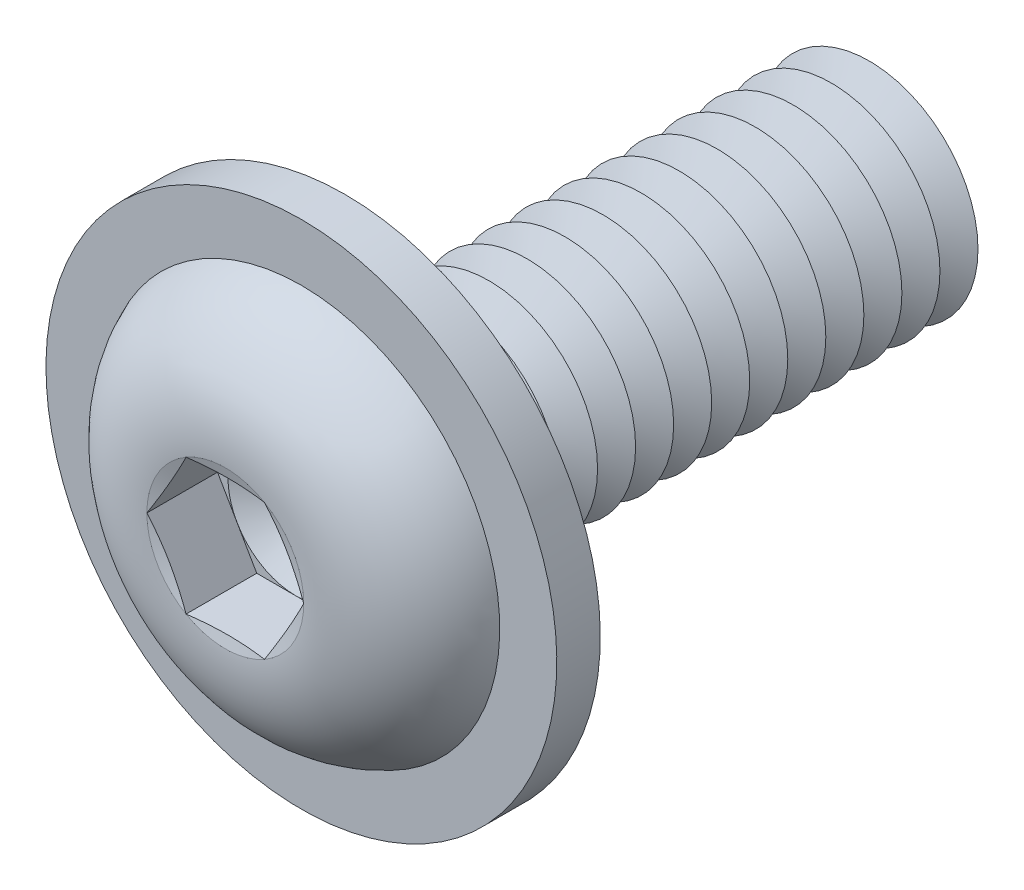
ISO-10303-21;
HEADER;
FILE_DESCRIPTION(('STEP AP214'),'2;1');
FILE_NAME('part.step','',(''),(''),'','','');
FILE_SCHEMA(('AUTOMOTIVE_DESIGN { 1 0 10303 214 1 1 1 1 }'));
ENDSEC;
DATA;
#1=APPLICATION_CONTEXT('core data for automotive mechanical design processes');
#2=APPLICATION_PROTOCOL_DEFINITION('international standard','automotive_design',2000,#1);
#3=PRODUCT_CONTEXT('',#1,'mechanical');
#4=PRODUCT('Part','Part','',(#3));
#5=PRODUCT_RELATED_PRODUCT_CATEGORY('part','',(#4));
#6=PRODUCT_DEFINITION_FORMATION('','',#4);
#7=PRODUCT_DEFINITION_CONTEXT('part definition',#1,'design');
#8=PRODUCT_DEFINITION('design','',#6,#7);
#9=PRODUCT_DEFINITION_SHAPE('','',#8);
#10=(LENGTH_UNIT() NAMED_UNIT(*) SI_UNIT(.MILLI.,.METRE.));
#11=(NAMED_UNIT(*) PLANE_ANGLE_UNIT() SI_UNIT($,.RADIAN.));
#12=(NAMED_UNIT(*) SI_UNIT($,.STERADIAN.) SOLID_ANGLE_UNIT());
#13=UNCERTAINTY_MEASURE_WITH_UNIT(LENGTH_MEASURE(1.E-05),#10,'distance_accuracy_value','');
#14=(GEOMETRIC_REPRESENTATION_CONTEXT(3) GLOBAL_UNCERTAINTY_ASSIGNED_CONTEXT((#13)) GLOBAL_UNIT_ASSIGNED_CONTEXT((#10,
#11,#12)) REPRESENTATION_CONTEXT('',''));
#15=CARTESIAN_POINT('',(0.,0.,0.));
#16=DIRECTION('',(0.,0.,1.));
#17=DIRECTION('',(1.,0.,0.));
#18=AXIS2_PLACEMENT_3D('',#15,#16,#17);
#19=CARTESIAN_POINT('',(0.,0.,-7.55));
#20=DIRECTION('',(0.,0.,1.));
#21=DIRECTION('',(1.,0.,0.));
#22=AXIS2_PLACEMENT_3D('',#19,#20,#21);
#23=CONICAL_SURFACE('',#22,2.,1.0471975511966);
#24=CARTESIAN_POINT('',(0.,0.,-7.9));
#25=DIRECTION('',(0.,0.,1.));
#26=DIRECTION('',(1.,0.,0.));
#27=AXIS2_PLACEMENT_3D('',#24,#25,#26);
#28=CIRCLE('',#27,1.3937822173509);
#29=CARTESIAN_POINT('',(1.3937822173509,0.,-7.9));
#30=VERTEX_POINT('',#29);
#31=EDGE_CURVE('E323',#30,#30,#28,.T.);
#32=ORIENTED_EDGE('',*,*,#31,.T.);
#33=EDGE_LOOP('',(#32));
#34=FACE_BOUND('',#33,.T.);
#35=CARTESIAN_POINT('',(0.,0.,-7.55));
#36=DIRECTION('',(0.,0.,1.));
#37=DIRECTION('',(1.,0.,0.));
#38=AXIS2_PLACEMENT_3D('',#35,#36,#37);
#39=CIRCLE('',#38,2.);
#40=CARTESIAN_POINT('',(2.,0.,-7.55));
#41=VERTEX_POINT('',#40);
#42=EDGE_CURVE('E319',#41,#41,#39,.T.);
#43=ORIENTED_EDGE('',*,*,#42,.F.);
#44=EDGE_LOOP('',(#43));
#45=FACE_BOUND('',#44,.T.);
#46=ADVANCED_FACE('F39',(#34,#45),#23,.T.);
#47=CARTESIAN_POINT('',(0.,0.,-7.9));
#48=DIRECTION('',(0.,0.,-1.));
#49=DIRECTION('',(-1.,0.,0.));
#50=AXIS2_PLACEMENT_3D('',#47,#48,#49);
#51=CONICAL_SURFACE('',#50,1.3937822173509,1.0471975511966);
#52=CARTESIAN_POINT('',(0.,0.,-8.25));
#53=DIRECTION('',(0.,0.,1.));
#54=DIRECTION('',(1.,0.,0.));
#55=AXIS2_PLACEMENT_3D('',#52,#53,#54);
#56=CIRCLE('',#55,2.);
#57=CARTESIAN_POINT('',(2.,0.,-8.25));
#58=VERTEX_POINT('',#57);
#59=EDGE_CURVE('E327',#58,#58,#56,.T.);
#60=ORIENTED_EDGE('',*,*,#59,.T.);
#61=EDGE_LOOP('',(#60));
#62=FACE_BOUND('',#61,.T.);
#63=ORIENTED_EDGE('',*,*,#31,.F.);
#64=EDGE_LOOP('',(#63));
#65=FACE_BOUND('',#64,.T.);
#66=ADVANCED_FACE('F448',(#62,#65),#51,.T.);
#67=CARTESIAN_POINT('',(0.,2.00000000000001,-10.));
#68=DIRECTION('',(0.,0.,-1.));
#69=DIRECTION('',(-1.,0.,0.));
#70=AXIS2_PLACEMENT_3D('',#67,#68,#69);
#71=PLANE('',#70);
#72=CARTESIAN_POINT('',(0.,0.,-10.));
#73=DIRECTION('',(0.,0.,1.));
#74=DIRECTION('',(1.,0.,0.));
#75=AXIS2_PLACEMENT_3D('',#72,#73,#74);
#76=CIRCLE('',#75,1.3937822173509);
#77=CARTESIAN_POINT('',(1.3937822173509,0.,-10.));
#78=VERTEX_POINT('',#77);
#79=EDGE_CURVE('E347',#78,#78,#76,.T.);
#80=ORIENTED_EDGE('',*,*,#79,.F.);
#81=EDGE_LOOP('',(#80));
#82=FACE_BOUND('',#81,.T.);
#83=ADVANCED_FACE('F454',(#82),#71,.T.);
#84=CARTESIAN_POINT('',(0.,0.,-9.65));
#85=DIRECTION('',(0.,0.,1.));
#86=DIRECTION('',(1.,0.,0.));
#87=AXIS2_PLACEMENT_3D('',#84,#85,#86);
#88=CONICAL_SURFACE('',#87,2.,1.0471975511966);
#89=ORIENTED_EDGE('',*,*,#79,.T.);
#90=EDGE_LOOP('',(#89));
#91=FACE_BOUND('',#90,.T.);
#92=CARTESIAN_POINT('',(0.,0.,-9.65));
#93=DIRECTION('',(0.,0.,1.));
#94=DIRECTION('',(1.,0.,0.));
#95=AXIS2_PLACEMENT_3D('',#92,#93,#94);
#96=CIRCLE('',#95,2.);
#97=CARTESIAN_POINT('',(2.,0.,-9.65));
#98=VERTEX_POINT('',#97);
#99=EDGE_CURVE('E343',#98,#98,#96,.T.);
#100=ORIENTED_EDGE('',*,*,#99,.F.);
#101=EDGE_LOOP('',(#100));
#102=FACE_BOUND('',#101,.T.);
#103=ADVANCED_FACE('F473',(#91,#102),#88,.T.);
#104=CARTESIAN_POINT('',(0.,0.,-9.3));
#105=DIRECTION('',(0.,0.,-1.));
#106=DIRECTION('',(-1.,0.,0.));
#107=AXIS2_PLACEMENT_3D('',#104,#105,#106);
#108=CONICAL_SURFACE('',#107,1.3937822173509,1.0471975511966);
#109=ORIENTED_EDGE('',*,*,#99,.T.);
#110=EDGE_LOOP('',(#109));
#111=FACE_BOUND('',#110,.T.);
#112=CARTESIAN_POINT('',(0.,0.,-9.3));
#113=DIRECTION('',(0.,0.,1.));
#114=DIRECTION('',(1.,0.,0.));
#115=AXIS2_PLACEMENT_3D('',#112,#113,#114);
#116=CIRCLE('',#115,1.3937822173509);
#117=CARTESIAN_POINT('',(1.3937822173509,0.,-9.3));
#118=VERTEX_POINT('',#117);
#119=EDGE_CURVE('E339',#118,#118,#116,.T.);
#120=ORIENTED_EDGE('',*,*,#119,.F.);
#121=EDGE_LOOP('',(#120));
#122=FACE_BOUND('',#121,.T.);
#123=ADVANCED_FACE('F470',(#111,#122),#108,.T.);
#124=CARTESIAN_POINT('',(0.,0.,-8.95));
#125=DIRECTION('',(0.,0.,1.));
#126=DIRECTION('',(1.,0.,0.));
#127=AXIS2_PLACEMENT_3D('',#124,#125,#126);
#128=CONICAL_SURFACE('',#127,2.,1.0471975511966);
#129=ORIENTED_EDGE('',*,*,#119,.T.);
#130=EDGE_LOOP('',(#129));
#131=FACE_BOUND('',#130,.T.);
#132=CARTESIAN_POINT('',(0.,0.,-8.95));
#133=DIRECTION('',(0.,0.,1.));
#134=DIRECTION('',(1.,0.,0.));
#135=AXIS2_PLACEMENT_3D('',#132,#133,#134);
#136=CIRCLE('',#135,2.);
#137=CARTESIAN_POINT('',(2.,0.,-8.95));
#138=VERTEX_POINT('',#137);
#139=EDGE_CURVE('E335',#138,#138,#136,.T.);
#140=ORIENTED_EDGE('',*,*,#139,.F.);
#141=EDGE_LOOP('',(#140));
#142=FACE_BOUND('',#141,.T.);
#143=ADVANCED_FACE('F464',(#131,#142),#128,.T.);
#144=CARTESIAN_POINT('',(0.,0.,-8.6));
#145=DIRECTION('',(0.,0.,-1.));
#146=DIRECTION('',(-1.,0.,0.));
#147=AXIS2_PLACEMENT_3D('',#144,#145,#146);
#148=CONICAL_SURFACE('',#147,1.3937822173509,1.0471975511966);
#149=ORIENTED_EDGE('',*,*,#139,.T.);
#150=EDGE_LOOP('',(#149));
#151=FACE_BOUND('',#150,.T.);
#152=CARTESIAN_POINT('',(0.,0.,-8.6));
#153=DIRECTION('',(0.,0.,1.));
#154=DIRECTION('',(1.,0.,0.));
#155=AXIS2_PLACEMENT_3D('',#152,#153,#154);
#156=CIRCLE('',#155,1.3937822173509);
#157=CARTESIAN_POINT('',(1.3937822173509,0.,-8.6));
#158=VERTEX_POINT('',#157);
#159=EDGE_CURVE('E331',#158,#158,#156,.T.);
#160=ORIENTED_EDGE('',*,*,#159,.F.);
#161=EDGE_LOOP('',(#160));
#162=FACE_BOUND('',#161,.T.);
#163=ADVANCED_FACE('F460',(#151,#162),#148,.T.);
#164=CARTESIAN_POINT('',(0.,0.,-8.25));
#165=DIRECTION('',(0.,0.,1.));
#166=DIRECTION('',(1.,0.,0.));
#167=AXIS2_PLACEMENT_3D('',#164,#165,#166);
#168=CONICAL_SURFACE('',#167,2.,1.0471975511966);
#169=ORIENTED_EDGE('',*,*,#159,.T.);
#170=EDGE_LOOP('',(#169));
#171=FACE_BOUND('',#170,.T.);
#172=ORIENTED_EDGE('',*,*,#59,.F.);
#173=EDGE_LOOP('',(#172));
#174=FACE_BOUND('',#173,.T.);
#175=ADVANCED_FACE('F463',(#171,#174),#168,.T.);
#176=CARTESIAN_POINT('',(0.,0.,-6.85));
#177=DIRECTION('',(0.,0.,1.));
#178=DIRECTION('',(1.,0.,0.));
#179=AXIS2_PLACEMENT_3D('',#176,#177,#178);
#180=CONICAL_SURFACE('',#179,2.,1.0471975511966);
#181=CARTESIAN_POINT('',(0.,0.,-7.2));
#182=DIRECTION('',(0.,0.,1.));
#183=DIRECTION('',(1.,0.,0.));
#184=AXIS2_PLACEMENT_3D('',#181,#182,#183);
#185=CIRCLE('',#184,1.3937822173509);
#186=CARTESIAN_POINT('',(1.3937822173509,0.,-7.2));
#187=VERTEX_POINT('',#186);
#188=EDGE_CURVE('E315',#187,#187,#185,.T.);
#189=ORIENTED_EDGE('',*,*,#188,.T.);
#190=EDGE_LOOP('',(#189));
#191=FACE_BOUND('',#190,.T.);
#192=CARTESIAN_POINT('',(0.,0.,-6.85));
#193=DIRECTION('',(0.,0.,1.));
#194=DIRECTION('',(1.,0.,0.));
#195=AXIS2_PLACEMENT_3D('',#192,#193,#194);
#196=CIRCLE('',#195,2.);
#197=CARTESIAN_POINT('',(2.,0.,-6.85));
#198=VERTEX_POINT('',#197);
#199=EDGE_CURVE('E311',#198,#198,#196,.T.);
#200=ORIENTED_EDGE('',*,*,#199,.F.);
#201=EDGE_LOOP('',(#200));
#202=FACE_BOUND('',#201,.T.);
#203=ADVANCED_FACE('F468',(#191,#202),#180,.T.);
#204=CARTESIAN_POINT('',(0.,0.,-7.2));
#205=DIRECTION('',(0.,0.,-1.));
#206=DIRECTION('',(-1.,0.,0.));
#207=AXIS2_PLACEMENT_3D('',#204,#205,#206);
#208=CONICAL_SURFACE('',#207,1.3937822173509,1.0471975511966);
#209=ORIENTED_EDGE('',*,*,#42,.T.);
#210=EDGE_LOOP('',(#209));
#211=FACE_BOUND('',#210,.T.);
#212=ORIENTED_EDGE('',*,*,#188,.F.);
#213=EDGE_LOOP('',(#212));
#214=FACE_BOUND('',#213,.T.);
#215=ADVANCED_FACE('F519',(#211,#214),#208,.T.);
#216=CARTESIAN_POINT('',(0.,0.,-6.15));
#217=DIRECTION('',(0.,0.,1.));
#218=DIRECTION('',(1.,0.,0.));
#219=AXIS2_PLACEMENT_3D('',#216,#217,#218);
#220=CONICAL_SURFACE('',#219,2.,1.0471975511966);
#221=CARTESIAN_POINT('',(0.,0.,-6.5));
#222=DIRECTION('',(0.,0.,1.));
#223=DIRECTION('',(1.,0.,0.));
#224=AXIS2_PLACEMENT_3D('',#221,#222,#223);
#225=CIRCLE('',#224,1.3937822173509);
#226=CARTESIAN_POINT('',(1.3937822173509,0.,-6.5));
#227=VERTEX_POINT('',#226);
#228=EDGE_CURVE('E307',#227,#227,#225,.T.);
#229=ORIENTED_EDGE('',*,*,#228,.T.);
#230=EDGE_LOOP('',(#229));
#231=FACE_BOUND('',#230,.T.);
#232=CARTESIAN_POINT('',(0.,0.,-6.15));
#233=DIRECTION('',(0.,0.,1.));
#234=DIRECTION('',(1.,0.,0.));
#235=AXIS2_PLACEMENT_3D('',#232,#233,#234);
#236=CIRCLE('',#235,2.);
#237=CARTESIAN_POINT('',(2.,0.,-6.15));
#238=VERTEX_POINT('',#237);
#239=EDGE_CURVE('E303',#238,#238,#236,.T.);
#240=ORIENTED_EDGE('',*,*,#239,.F.);
#241=EDGE_LOOP('',(#240));
#242=FACE_BOUND('',#241,.T.);
#243=ADVANCED_FACE('F525',(#231,#242),#220,.T.);
#244=CARTESIAN_POINT('',(0.,0.,-6.5));
#245=DIRECTION('',(0.,0.,-1.));
#246=DIRECTION('',(-1.,0.,0.));
#247=AXIS2_PLACEMENT_3D('',#244,#245,#246);
#248=CONICAL_SURFACE('',#247,1.3937822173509,1.0471975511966);
#249=ORIENTED_EDGE('',*,*,#199,.T.);
#250=EDGE_LOOP('',(#249));
#251=FACE_BOUND('',#250,.T.);
#252=ORIENTED_EDGE('',*,*,#228,.F.);
#253=EDGE_LOOP('',(#252));
#254=FACE_BOUND('',#253,.T.);
#255=ADVANCED_FACE('F532',(#251,#254),#248,.T.);
#256=CARTESIAN_POINT('',(0.,0.,-5.45));
#257=DIRECTION('',(0.,0.,1.));
#258=DIRECTION('',(1.,0.,0.));
#259=AXIS2_PLACEMENT_3D('',#256,#257,#258);
#260=CONICAL_SURFACE('',#259,2.,1.0471975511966);
#261=CARTESIAN_POINT('',(0.,0.,-5.8));
#262=DIRECTION('',(0.,0.,1.));
#263=DIRECTION('',(1.,0.,0.));
#264=AXIS2_PLACEMENT_3D('',#261,#262,#263);
#265=CIRCLE('',#264,1.3937822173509);
#266=CARTESIAN_POINT('',(1.3937822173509,0.,-5.8));
#267=VERTEX_POINT('',#266);
#268=EDGE_CURVE('E299',#267,#267,#265,.T.);
#269=ORIENTED_EDGE('',*,*,#268,.T.);
#270=EDGE_LOOP('',(#269));
#271=FACE_BOUND('',#270,.T.);
#272=CARTESIAN_POINT('',(0.,0.,-5.45));
#273=DIRECTION('',(0.,0.,1.));
#274=DIRECTION('',(1.,0.,0.));
#275=AXIS2_PLACEMENT_3D('',#272,#273,#274);
#276=CIRCLE('',#275,2.);
#277=CARTESIAN_POINT('',(2.,0.,-5.45));
#278=VERTEX_POINT('',#277);
#279=EDGE_CURVE('E295',#278,#278,#276,.T.);
#280=ORIENTED_EDGE('',*,*,#279,.F.);
#281=EDGE_LOOP('',(#280));
#282=FACE_BOUND('',#281,.T.);
#283=ADVANCED_FACE('F539',(#271,#282),#260,.T.);
#284=CARTESIAN_POINT('',(0.,0.,-5.8));
#285=DIRECTION('',(0.,0.,-1.));
#286=DIRECTION('',(-1.,0.,0.));
#287=AXIS2_PLACEMENT_3D('',#284,#285,#286);
#288=CONICAL_SURFACE('',#287,1.3937822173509,1.0471975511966);
#289=ORIENTED_EDGE('',*,*,#239,.T.);
#290=EDGE_LOOP('',(#289));
#291=FACE_BOUND('',#290,.T.);
#292=ORIENTED_EDGE('',*,*,#268,.F.);
#293=EDGE_LOOP('',(#292));
#294=FACE_BOUND('',#293,.T.);
#295=ADVANCED_FACE('F546',(#291,#294),#288,.T.);
#296=CARTESIAN_POINT('',(0.,0.,-4.75));
#297=DIRECTION('',(0.,0.,1.));
#298=DIRECTION('',(1.,0.,0.));
#299=AXIS2_PLACEMENT_3D('',#296,#297,#298);
#300=CONICAL_SURFACE('',#299,2.,1.0471975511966);
#301=CARTESIAN_POINT('',(0.,0.,-5.1));
#302=DIRECTION('',(0.,0.,1.));
#303=DIRECTION('',(1.,0.,0.));
#304=AXIS2_PLACEMENT_3D('',#301,#302,#303);
#305=CIRCLE('',#304,1.3937822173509);
#306=CARTESIAN_POINT('',(1.3937822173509,0.,-5.1));
#307=VERTEX_POINT('',#306);
#308=EDGE_CURVE('E291',#307,#307,#305,.T.);
#309=ORIENTED_EDGE('',*,*,#308,.T.);
#310=EDGE_LOOP('',(#309));
#311=FACE_BOUND('',#310,.T.);
#312=CARTESIAN_POINT('',(0.,0.,-4.75));
#313=DIRECTION('',(0.,0.,1.));
#314=DIRECTION('',(1.,0.,0.));
#315=AXIS2_PLACEMENT_3D('',#312,#313,#314);
#316=CIRCLE('',#315,2.);
#317=CARTESIAN_POINT('',(2.,0.,-4.75));
#318=VERTEX_POINT('',#317);
#319=EDGE_CURVE('E287',#318,#318,#316,.T.);
#320=ORIENTED_EDGE('',*,*,#319,.F.);
#321=EDGE_LOOP('',(#320));
#322=FACE_BOUND('',#321,.T.);
#323=ADVANCED_FACE('F553',(#311,#322),#300,.T.);
#324=CARTESIAN_POINT('',(0.,0.,-5.1));
#325=DIRECTION('',(0.,0.,-1.));
#326=DIRECTION('',(-1.,0.,0.));
#327=AXIS2_PLACEMENT_3D('',#324,#325,#326);
#328=CONICAL_SURFACE('',#327,1.3937822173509,1.0471975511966);
#329=ORIENTED_EDGE('',*,*,#279,.T.);
#330=EDGE_LOOP('',(#329));
#331=FACE_BOUND('',#330,.T.);
#332=ORIENTED_EDGE('',*,*,#308,.F.);
#333=EDGE_LOOP('',(#332));
#334=FACE_BOUND('',#333,.T.);
#335=ADVANCED_FACE('F560',(#331,#334),#328,.T.);
#336=CARTESIAN_POINT('',(0.,0.,-4.05));
#337=DIRECTION('',(0.,0.,1.));
#338=DIRECTION('',(1.,0.,0.));
#339=AXIS2_PLACEMENT_3D('',#336,#337,#338);
#340=CONICAL_SURFACE('',#339,2.,1.0471975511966);
#341=CARTESIAN_POINT('',(0.,0.,-4.4));
#342=DIRECTION('',(0.,0.,1.));
#343=DIRECTION('',(1.,0.,0.));
#344=AXIS2_PLACEMENT_3D('',#341,#342,#343);
#345=CIRCLE('',#344,1.3937822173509);
#346=CARTESIAN_POINT('',(1.3937822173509,0.,-4.4));
#347=VERTEX_POINT('',#346);
#348=EDGE_CURVE('E283',#347,#347,#345,.T.);
#349=ORIENTED_EDGE('',*,*,#348,.T.);
#350=EDGE_LOOP('',(#349));
#351=FACE_BOUND('',#350,.T.);
#352=CARTESIAN_POINT('',(0.,0.,-4.05));
#353=DIRECTION('',(0.,0.,1.));
#354=DIRECTION('',(1.,0.,0.));
#355=AXIS2_PLACEMENT_3D('',#352,#353,#354);
#356=CIRCLE('',#355,2.);
#357=CARTESIAN_POINT('',(2.,0.,-4.05));
#358=VERTEX_POINT('',#357);
#359=EDGE_CURVE('E279',#358,#358,#356,.T.);
#360=ORIENTED_EDGE('',*,*,#359,.F.);
#361=EDGE_LOOP('',(#360));
#362=FACE_BOUND('',#361,.T.);
#363=ADVANCED_FACE('F567',(#351,#362),#340,.T.);
#364=CARTESIAN_POINT('',(0.,0.,-4.4));
#365=DIRECTION('',(0.,0.,-1.));
#366=DIRECTION('',(-1.,0.,0.));
#367=AXIS2_PLACEMENT_3D('',#364,#365,#366);
#368=CONICAL_SURFACE('',#367,1.3937822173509,1.0471975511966);
#369=ORIENTED_EDGE('',*,*,#319,.T.);
#370=EDGE_LOOP('',(#369));
#371=FACE_BOUND('',#370,.T.);
#372=ORIENTED_EDGE('',*,*,#348,.F.);
#373=EDGE_LOOP('',(#372));
#374=FACE_BOUND('',#373,.T.);
#375=ADVANCED_FACE('F574',(#371,#374),#368,.T.);
#376=CARTESIAN_POINT('',(0.,0.,-3.35));
#377=DIRECTION('',(0.,0.,1.));
#378=DIRECTION('',(1.,0.,0.));
#379=AXIS2_PLACEMENT_3D('',#376,#377,#378);
#380=CONICAL_SURFACE('',#379,2.,1.0471975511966);
#381=CARTESIAN_POINT('',(0.,0.,-3.7));
#382=DIRECTION('',(0.,0.,1.));
#383=DIRECTION('',(1.,0.,0.));
#384=AXIS2_PLACEMENT_3D('',#381,#382,#383);
#385=CIRCLE('',#384,1.3937822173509);
#386=CARTESIAN_POINT('',(1.3937822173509,0.,-3.7));
#387=VERTEX_POINT('',#386);
#388=EDGE_CURVE('E275',#387,#387,#385,.T.);
#389=ORIENTED_EDGE('',*,*,#388,.T.);
#390=EDGE_LOOP('',(#389));
#391=FACE_BOUND('',#390,.T.);
#392=CARTESIAN_POINT('',(0.,0.,-3.35));
#393=DIRECTION('',(0.,0.,1.));
#394=DIRECTION('',(1.,0.,0.));
#395=AXIS2_PLACEMENT_3D('',#392,#393,#394);
#396=CIRCLE('',#395,2.);
#397=CARTESIAN_POINT('',(2.,0.,-3.35));
#398=VERTEX_POINT('',#397);
#399=EDGE_CURVE('E271',#398,#398,#396,.T.);
#400=ORIENTED_EDGE('',*,*,#399,.F.);
#401=EDGE_LOOP('',(#400));
#402=FACE_BOUND('',#401,.T.);
#403=ADVANCED_FACE('F581',(#391,#402),#380,.T.);
#404=CARTESIAN_POINT('',(0.,0.,-3.7));
#405=DIRECTION('',(0.,0.,-1.));
#406=DIRECTION('',(-1.,0.,0.));
#407=AXIS2_PLACEMENT_3D('',#404,#405,#406);
#408=CONICAL_SURFACE('',#407,1.3937822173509,1.0471975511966);
#409=ORIENTED_EDGE('',*,*,#359,.T.);
#410=EDGE_LOOP('',(#409));
#411=FACE_BOUND('',#410,.T.);
#412=ORIENTED_EDGE('',*,*,#388,.F.);
#413=EDGE_LOOP('',(#412));
#414=FACE_BOUND('',#413,.T.);
#415=ADVANCED_FACE('F588',(#411,#414),#408,.T.);
#416=CARTESIAN_POINT('',(0.,0.,-2.65));
#417=DIRECTION('',(0.,0.,1.));
#418=DIRECTION('',(1.,0.,0.));
#419=AXIS2_PLACEMENT_3D('',#416,#417,#418);
#420=CONICAL_SURFACE('',#419,2.,1.0471975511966);
#421=CARTESIAN_POINT('',(0.,0.,-3.));
#422=DIRECTION('',(0.,0.,1.));
#423=DIRECTION('',(1.,0.,0.));
#424=AXIS2_PLACEMENT_3D('',#421,#422,#423);
#425=CIRCLE('',#424,1.3937822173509);
#426=CARTESIAN_POINT('',(1.3937822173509,0.,-3.));
#427=VERTEX_POINT('',#426);
#428=EDGE_CURVE('E267',#427,#427,#425,.T.);
#429=ORIENTED_EDGE('',*,*,#428,.T.);
#430=EDGE_LOOP('',(#429));
#431=FACE_BOUND('',#430,.T.);
#432=CARTESIAN_POINT('',(0.,0.,-2.65));
#433=DIRECTION('',(0.,0.,1.));
#434=DIRECTION('',(1.,0.,0.));
#435=AXIS2_PLACEMENT_3D('',#432,#433,#434);
#436=CIRCLE('',#435,2.);
#437=CARTESIAN_POINT('',(2.,0.,-2.65));
#438=VERTEX_POINT('',#437);
#439=EDGE_CURVE('E263',#438,#438,#436,.T.);
#440=ORIENTED_EDGE('',*,*,#439,.F.);
#441=EDGE_LOOP('',(#440));
#442=FACE_BOUND('',#441,.T.);
#443=ADVANCED_FACE('F595',(#431,#442),#420,.T.);
#444=CARTESIAN_POINT('',(0.,0.,-3.));
#445=DIRECTION('',(0.,0.,-1.));
#446=DIRECTION('',(-1.,0.,0.));
#447=AXIS2_PLACEMENT_3D('',#444,#445,#446);
#448=CONICAL_SURFACE('',#447,1.3937822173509,1.0471975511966);
#449=ORIENTED_EDGE('',*,*,#399,.T.);
#450=EDGE_LOOP('',(#449));
#451=FACE_BOUND('',#450,.T.);
#452=ORIENTED_EDGE('',*,*,#428,.F.);
#453=EDGE_LOOP('',(#452));
#454=FACE_BOUND('',#453,.T.);
#455=ADVANCED_FACE('F602',(#451,#454),#448,.T.);
#456=CARTESIAN_POINT('',(0.,0.,-1.95));
#457=DIRECTION('',(0.,0.,1.));
#458=DIRECTION('',(1.,0.,0.));
#459=AXIS2_PLACEMENT_3D('',#456,#457,#458);
#460=CONICAL_SURFACE('',#459,2.,1.0471975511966);
#461=CARTESIAN_POINT('',(0.,0.,-2.3));
#462=DIRECTION('',(0.,0.,1.));
#463=DIRECTION('',(1.,0.,0.));
#464=AXIS2_PLACEMENT_3D('',#461,#462,#463);
#465=CIRCLE('',#464,1.3937822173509);
#466=CARTESIAN_POINT('',(1.3937822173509,0.,-2.3));
#467=VERTEX_POINT('',#466);
#468=EDGE_CURVE('E259',#467,#467,#465,.T.);
#469=ORIENTED_EDGE('',*,*,#468,.T.);
#470=EDGE_LOOP('',(#469));
#471=FACE_BOUND('',#470,.T.);
#472=CARTESIAN_POINT('',(0.,0.,-1.95));
#473=DIRECTION('',(0.,0.,1.));
#474=DIRECTION('',(1.,0.,0.));
#475=AXIS2_PLACEMENT_3D('',#472,#473,#474);
#476=CIRCLE('',#475,2.);
#477=CARTESIAN_POINT('',(2.,0.,-1.95));
#478=VERTEX_POINT('',#477);
#479=EDGE_CURVE('E255',#478,#478,#476,.T.);
#480=ORIENTED_EDGE('',*,*,#479,.F.);
#481=EDGE_LOOP('',(#480));
#482=FACE_BOUND('',#481,.T.);
#483=ADVANCED_FACE('F609',(#471,#482),#460,.T.);
#484=CARTESIAN_POINT('',(0.,0.,-2.3));
#485=DIRECTION('',(0.,0.,-1.));
#486=DIRECTION('',(-1.,0.,0.));
#487=AXIS2_PLACEMENT_3D('',#484,#485,#486);
#488=CONICAL_SURFACE('',#487,1.3937822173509,1.0471975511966);
#489=ORIENTED_EDGE('',*,*,#439,.T.);
#490=EDGE_LOOP('',(#489));
#491=FACE_BOUND('',#490,.T.);
#492=ORIENTED_EDGE('',*,*,#468,.F.);
#493=EDGE_LOOP('',(#492));
#494=FACE_BOUND('',#493,.T.);
#495=ADVANCED_FACE('F616',(#491,#494),#488,.T.);
#496=CARTESIAN_POINT('',(0.,0.,-1.25));
#497=DIRECTION('',(0.,0.,1.));
#498=DIRECTION('',(1.,0.,0.));
#499=AXIS2_PLACEMENT_3D('',#496,#497,#498);
#500=CONICAL_SURFACE('',#499,2.,1.0471975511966);
#501=CARTESIAN_POINT('',(0.,0.,-1.6));
#502=DIRECTION('',(0.,0.,1.));
#503=DIRECTION('',(1.,0.,0.));
#504=AXIS2_PLACEMENT_3D('',#501,#502,#503);
#505=CIRCLE('',#504,1.3937822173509);
#506=CARTESIAN_POINT('',(1.3937822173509,0.,-1.6));
#507=VERTEX_POINT('',#506);
#508=EDGE_CURVE('E251',#507,#507,#505,.T.);
#509=ORIENTED_EDGE('',*,*,#508,.T.);
#510=EDGE_LOOP('',(#509));
#511=FACE_BOUND('',#510,.T.);
#512=CARTESIAN_POINT('',(0.,0.,-1.25));
#513=DIRECTION('',(0.,0.,1.));
#514=DIRECTION('',(1.,0.,0.));
#515=AXIS2_PLACEMENT_3D('',#512,#513,#514);
#516=CIRCLE('',#515,2.);
#517=CARTESIAN_POINT('',(2.,0.,-1.25));
#518=VERTEX_POINT('',#517);
#519=EDGE_CURVE('E243',#518,#518,#516,.T.);
#520=ORIENTED_EDGE('',*,*,#519,.F.);
#521=EDGE_LOOP('',(#520));
#522=FACE_BOUND('',#521,.T.);
#523=ADVANCED_FACE('F623',(#511,#522),#500,.T.);
#524=CARTESIAN_POINT('',(0.,0.,-1.6));
#525=DIRECTION('',(0.,0.,-1.));
#526=DIRECTION('',(-1.,0.,0.));
#527=AXIS2_PLACEMENT_3D('',#524,#525,#526);
#528=CONICAL_SURFACE('',#527,1.3937822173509,1.0471975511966);
#529=ORIENTED_EDGE('',*,*,#479,.T.);
#530=EDGE_LOOP('',(#529));
#531=FACE_BOUND('',#530,.T.);
#532=ORIENTED_EDGE('',*,*,#508,.F.);
#533=EDGE_LOOP('',(#532));
#534=FACE_BOUND('',#533,.T.);
#535=ADVANCED_FACE('F630',(#531,#534),#528,.T.);
#536=CARTESIAN_POINT('',(0.,0.,-0.549999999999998));
#537=DIRECTION('',(0.,0.,1.));
#538=DIRECTION('',(1.,0.,0.));
#539=AXIS2_PLACEMENT_3D('',#536,#537,#538);
#540=CONICAL_SURFACE('',#539,2.,1.0471975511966);
#541=CARTESIAN_POINT('',(0.,0.,-0.899999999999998));
#542=DIRECTION('',(0.,0.,1.));
#543=DIRECTION('',(1.,0.,0.));
#544=AXIS2_PLACEMENT_3D('',#541,#542,#543);
#545=CIRCLE('',#544,1.3937822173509);
#546=CARTESIAN_POINT('',(1.3937822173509,0.,-0.899999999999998));
#547=VERTEX_POINT('',#546);
#548=EDGE_CURVE('E232',#547,#547,#545,.T.);
#549=ORIENTED_EDGE('',*,*,#548,.T.);
#550=EDGE_LOOP('',(#549));
#551=FACE_BOUND('',#550,.T.);
#552=CARTESIAN_POINT('',(0.,0.,-0.549999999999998));
#553=DIRECTION('',(0.,0.,1.));
#554=DIRECTION('',(1.,0.,0.));
#555=AXIS2_PLACEMENT_3D('',#552,#553,#554);
#556=CIRCLE('',#555,2.);
#557=CARTESIAN_POINT('',(2.,0.,-0.549999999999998));
#558=VERTEX_POINT('',#557);
#559=EDGE_CURVE('E247',#558,#558,#556,.T.);
#560=ORIENTED_EDGE('',*,*,#559,.F.);
#561=EDGE_LOOP('',(#560));
#562=FACE_BOUND('',#561,.T.);
#563=ADVANCED_FACE('F637',(#551,#562),#540,.T.);
#564=CARTESIAN_POINT('',(0.,0.,-0.899999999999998));
#565=DIRECTION('',(0.,0.,-1.));
#566=DIRECTION('',(-1.,0.,0.));
#567=AXIS2_PLACEMENT_3D('',#564,#565,#566);
#568=CONICAL_SURFACE('',#567,1.3937822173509,1.0471975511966);
#569=ORIENTED_EDGE('',*,*,#519,.T.);
#570=EDGE_LOOP('',(#569));
#571=FACE_BOUND('',#570,.T.);
#572=ORIENTED_EDGE('',*,*,#548,.F.);
#573=EDGE_LOOP('',(#572));
#574=FACE_BOUND('',#573,.T.);
#575=ADVANCED_FACE('F221',(#571,#574),#568,.T.);
#576=CARTESIAN_POINT('',(0.,2.,0.));
#577=DIRECTION('',(0.,0.,-1.));
#578=DIRECTION('',(-1.,0.,0.));
#579=AXIS2_PLACEMENT_3D('',#576,#577,#578);
#580=PLANE('',#579);
#581=CARTESIAN_POINT('',(0.,0.,0.));
#582=DIRECTION('',(0.,0.,-1.));
#583=DIRECTION('',(-1.,0.,0.));
#584=AXIS2_PLACEMENT_3D('',#581,#582,#583);
#585=CIRCLE('',#584,2.35);
#586=CARTESIAN_POINT('',(-2.35,0.,0.));
#587=VERTEX_POINT('',#586);
#588=EDGE_CURVE('E361',#587,#587,#585,.F.);
#589=ORIENTED_EDGE('',*,*,#588,.T.);
#590=EDGE_LOOP('',(#589));
#591=FACE_BOUND('',#590,.T.);
#592=CARTESIAN_POINT('',(0.,0.,0.));
#593=DIRECTION('',(0.,0.,-1.));
#594=DIRECTION('',(0.,1.,0.));
#595=AXIS2_PLACEMENT_3D('',#592,#593,#594);
#596=CIRCLE('',#595,4.7);
#597=CARTESIAN_POINT('',(0.,4.7,0.));
#598=VERTEX_POINT('',#597);
#599=EDGE_CURVE('E985',#598,#598,#596,.T.);
#600=ORIENTED_EDGE('',*,*,#599,.T.);
#601=EDGE_LOOP('',(#600));
#602=FACE_BOUND('',#601,.T.);
#603=ADVANCED_FACE('F649',(#591,#602),#580,.T.);
#604=CARTESIAN_POINT('',(0.,0.,-0.35));
#605=DIRECTION('',(0.,0.,-1.));
#606=DIRECTION('',(-1.,0.,0.));
#607=AXIS2_PLACEMENT_3D('',#604,#605,#606);
#608=TOROIDAL_SURFACE('',#607,2.35,0.35);
#609=ORIENTED_EDGE('',*,*,#588,.F.);
#610=EDGE_LOOP('',(#609));
#611=FACE_BOUND('',#610,.T.);
#612=CARTESIAN_POINT('',(0.,0.,-0.35));
#613=DIRECTION('',(0.,0.,-1.));
#614=DIRECTION('',(-1.,0.,0.));
#615=AXIS2_PLACEMENT_3D('',#612,#613,#614);
#616=CIRCLE('',#615,2.);
#617=CARTESIAN_POINT('',(-2.,0.,-0.35));
#618=VERTEX_POINT('',#617);
#619=EDGE_CURVE('E356',#618,#618,#616,.T.);
#620=ORIENTED_EDGE('',*,*,#619,.F.);
#621=EDGE_LOOP('',(#620));
#622=FACE_BOUND('',#621,.T.);
#623=ADVANCED_FACE('F41',(#611,#622),#608,.F.);
#624=CARTESIAN_POINT('',(0.,0.,-10.));
#625=DIRECTION('',(0.,0.,-1.));
#626=DIRECTION('',(-1.,0.,0.));
#627=AXIS2_PLACEMENT_3D('',#624,#625,#626);
#628=CYLINDRICAL_SURFACE('',#627,2.);
#629=ORIENTED_EDGE('',*,*,#619,.T.);
#630=EDGE_LOOP('',(#629));
#631=FACE_BOUND('',#630,.T.);
#632=ORIENTED_EDGE('',*,*,#559,.T.);
#633=EDGE_LOOP('',(#632));
#634=FACE_BOUND('',#633,.T.);
#635=ADVANCED_FACE('F661',(#631,#634),#628,.T.);
#636=CARTESIAN_POINT('',(0.,0.,0.8));
#637=DIRECTION('',(0.,0.,-1.));
#638=DIRECTION('',(0.,1.,0.));
#639=AXIS2_PLACEMENT_3D('',#636,#637,#638);
#640=CYLINDRICAL_SURFACE('',#639,4.7);
#641=CARTESIAN_POINT('',(0.,0.,0.8));
#642=DIRECTION('',(0.,0.,-1.));
#643=DIRECTION('',(0.,1.,0.));
#644=AXIS2_PLACEMENT_3D('',#641,#642,#643);
#645=CIRCLE('',#644,4.7);
#646=CARTESIAN_POINT('',(0.,4.7,0.8));
#647=VERTEX_POINT('',#646);
#648=EDGE_CURVE('E987',#647,#647,#645,.T.);
#649=ORIENTED_EDGE('',*,*,#648,.T.);
#650=EDGE_LOOP('',(#649));
#651=FACE_BOUND('',#650,.T.);
#652=ORIENTED_EDGE('',*,*,#599,.F.);
#653=EDGE_LOOP('',(#652));
#654=FACE_BOUND('',#653,.T.);
#655=ADVANCED_FACE('F667',(#651,#654),#640,.T.);
#656=CARTESIAN_POINT('',(0.,0.,0.8));
#657=DIRECTION('',(0.,0.,-1.));
#658=DIRECTION('',(0.,1.,0.));
#659=AXIS2_PLACEMENT_3D('',#656,#657,#658);
#660=PLANE('',#659);
#661=CARTESIAN_POINT('',(0.,0.,0.8));
#662=DIRECTION('',(0.,0.,-1.));
#663=DIRECTION('',(0.,1.,0.));
#664=AXIS2_PLACEMENT_3D('',#661,#662,#663);
#665=CIRCLE('',#664,3.64977164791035);
#666=CARTESIAN_POINT('',(0.,3.64977164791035,0.8));
#667=VERTEX_POINT('',#666);
#668=EDGE_CURVE('E43',#667,#667,#665,.F.);
#669=ORIENTED_EDGE('',*,*,#668,.F.);
#670=EDGE_LOOP('',(#669));
#671=FACE_BOUND('',#670,.T.);
#672=ORIENTED_EDGE('',*,*,#648,.F.);
#673=EDGE_LOOP('',(#672));
#674=FACE_BOUND('',#673,.T.);
#675=ADVANCED_FACE('F117',(#671,#674),#660,.F.);
#676=CARTESIAN_POINT('',(0.,0.,0.9));
#677=DIRECTION('',(0.,0.,1.));
#678=DIRECTION('',(1.,0.,0.));
#679=AXIS2_PLACEMENT_3D('',#676,#677,#678);
#680=CONICAL_SURFACE('',#679,1.24999941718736,1.0471975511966);
#681=CARTESIAN_POINT('',(0.,0.,0.178312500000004));
#682=VERTEX_POINT('',#681);
#683=VERTEX_LOOP('',#682);
#684=FACE_BOUND('',#683,.T.);
#685=CARTESIAN_POINT('',(0.,0.,0.9));
#686=DIRECTION('',(0.,0.,1.));
#687=DIRECTION('',(1.,0.,0.));
#688=AXIS2_PLACEMENT_3D('',#685,#686,#687);
#689=CIRCLE('',#688,1.24999941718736);
#690=CARTESIAN_POINT('',(1.08253125,0.624999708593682,0.9));
#691=VERTEX_POINT('',#690);
#692=CARTESIAN_POINT('',(0.,1.24999941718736,0.9));
#693=VERTEX_POINT('',#692);
#694=EDGE_CURVE('E120',#691,#693,#689,.T.);
#695=ORIENTED_EDGE('',*,*,#694,.T.);
#696=CARTESIAN_POINT('',(0.,0.,0.9));
#697=DIRECTION('',(0.,0.,1.));
#698=DIRECTION('',(1.,0.,0.));
#699=AXIS2_PLACEMENT_3D('',#696,#697,#698);
#700=CIRCLE('',#699,1.24999941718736);
#701=CARTESIAN_POINT('',(-1.08253125,0.624999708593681,0.9));
#702=VERTEX_POINT('',#701);
#703=EDGE_CURVE('E11',#693,#702,#700,.T.);
#704=ORIENTED_EDGE('',*,*,#703,.T.);
#705=CARTESIAN_POINT('',(-1.08253125,-0.624999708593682,0.9));
#706=VERTEX_POINT('',#705);
#707=EDGE_CURVE('E49',#702,#706,#700,.T.);
#708=ORIENTED_EDGE('',*,*,#707,.T.);
#709=CARTESIAN_POINT('',(0.,-1.24999941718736,0.9));
#710=VERTEX_POINT('',#709);
#711=EDGE_CURVE('E365',#706,#710,#700,.T.);
#712=ORIENTED_EDGE('',*,*,#711,.T.);
#713=CARTESIAN_POINT('',(1.08253125,-0.624999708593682,0.9));
#714=VERTEX_POINT('',#713);
#715=EDGE_CURVE('E57',#710,#714,#700,.T.);
#716=ORIENTED_EDGE('',*,*,#715,.T.);
#717=EDGE_CURVE('E50',#714,#691,#700,.T.);
#718=ORIENTED_EDGE('',*,*,#717,.T.);
#719=EDGE_LOOP('',(#695,#704,#708,#712,#716,#718));
#720=FACE_BOUND('',#719,.T.);
#721=ADVANCED_FACE('F114',(#684,#720),#680,.F.);
#722=CARTESIAN_POINT('',(0.,0.,0.9));
#723=DIRECTION('',(0.,0.,1.));
#724=DIRECTION('',(1.,0.,0.));
#725=AXIS2_PLACEMENT_3D('',#722,#723,#724);
#726=PLANE('',#725);
#727=ORIENTED_EDGE('',*,*,#711,.F.);
#728=DIRECTION('',(0.5,-0.866025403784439,0.));
#729=VECTOR('',#728,1.);
#730=CARTESIAN_POINT('',(-1.443375,0.,0.9));
#731=LINE('',#730,#729);
#732=CARTESIAN_POINT('',(-0.7216875,-1.24999941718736,0.9));
#733=VERTEX_POINT('',#732);
#734=EDGE_CURVE('E154',#706,#733,#731,.T.);
#735=ORIENTED_EDGE('',*,*,#734,.T.);
#736=DIRECTION('',(1.,0.,0.));
#737=VECTOR('',#736,1.);
#738=CARTESIAN_POINT('',(-0.7216875,-1.24999941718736,0.9));
#739=LINE('',#738,#737);
#740=EDGE_CURVE('E160',#733,#710,#739,.T.);
#741=ORIENTED_EDGE('',*,*,#740,.T.);
#742=EDGE_LOOP('',(#727,#735,#741));
#743=FACE_BOUND('',#742,.T.);
#744=ADVANCED_FACE('F116',(#743),#726,.T.);
#745=ORIENTED_EDGE('',*,*,#715,.F.);
#746=CARTESIAN_POINT('',(0.721687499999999,-1.24999941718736,0.9));
#747=VERTEX_POINT('',#746);
#748=EDGE_CURVE('E159',#710,#747,#739,.T.);
#749=ORIENTED_EDGE('',*,*,#748,.T.);
#750=DIRECTION('',(0.5,0.866025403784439,0.));
#751=VECTOR('',#750,1.);
#752=CARTESIAN_POINT('',(0.721687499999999,-1.24999941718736,0.9));
#753=LINE('',#752,#751);
#754=EDGE_CURVE('E165',#747,#714,#753,.T.);
#755=ORIENTED_EDGE('',*,*,#754,.T.);
#756=EDGE_LOOP('',(#745,#749,#755));
#757=FACE_BOUND('',#756,.T.);
#758=ADVANCED_FACE('F688',(#757),#726,.T.);
#759=ORIENTED_EDGE('',*,*,#717,.F.);
#760=CARTESIAN_POINT('',(1.443375,0.,0.9));
#761=VERTEX_POINT('',#760);
#762=EDGE_CURVE('E164',#714,#761,#753,.T.);
#763=ORIENTED_EDGE('',*,*,#762,.T.);
#764=DIRECTION('',(-0.5,0.866025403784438,0.));
#765=VECTOR('',#764,1.);
#766=CARTESIAN_POINT('',(1.443375,0.,0.9));
#767=LINE('',#766,#765);
#768=EDGE_CURVE('E142',#761,#691,#767,.T.);
#769=ORIENTED_EDGE('',*,*,#768,.T.);
#770=EDGE_LOOP('',(#759,#763,#769));
#771=FACE_BOUND('',#770,.T.);
#772=ADVANCED_FACE('F693',(#771),#726,.T.);
#773=ORIENTED_EDGE('',*,*,#694,.F.);
#774=CARTESIAN_POINT('',(0.7216875,1.24999941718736,0.9));
#775=VERTEX_POINT('',#774);
#776=EDGE_CURVE('E127',#691,#775,#767,.T.);
#777=ORIENTED_EDGE('',*,*,#776,.T.);
#778=DIRECTION('',(-1.,0.,0.));
#779=VECTOR('',#778,1.);
#780=CARTESIAN_POINT('',(0.7216875,1.24999941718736,0.9));
#781=LINE('',#780,#779);
#782=EDGE_CURVE('E138',#775,#693,#781,.T.);
#783=ORIENTED_EDGE('',*,*,#782,.T.);
#784=EDGE_LOOP('',(#773,#777,#783));
#785=FACE_BOUND('',#784,.T.);
#786=ADVANCED_FACE('F144',(#785),#726,.T.);
#787=ORIENTED_EDGE('',*,*,#703,.F.);
#788=CARTESIAN_POINT('',(-0.721687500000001,1.24999941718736,0.9));
#789=VERTEX_POINT('',#788);
#790=EDGE_CURVE('E133',#693,#789,#781,.T.);
#791=ORIENTED_EDGE('',*,*,#790,.T.);
#792=DIRECTION('',(-0.5,-0.866025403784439,0.));
#793=VECTOR('',#792,1.);
#794=CARTESIAN_POINT('',(-0.721687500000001,1.24999941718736,0.9));
#795=LINE('',#794,#793);
#796=EDGE_CURVE('E136',#789,#702,#795,.T.);
#797=ORIENTED_EDGE('',*,*,#796,.T.);
#798=EDGE_LOOP('',(#787,#791,#797));
#799=FACE_BOUND('',#798,.T.);
#800=ADVANCED_FACE('F132',(#799),#726,.T.);
#801=ORIENTED_EDGE('',*,*,#707,.F.);
#802=CARTESIAN_POINT('',(-1.443375,0.,0.9));
#803=VERTEX_POINT('',#802);
#804=EDGE_CURVE('E146',#702,#803,#795,.T.);
#805=ORIENTED_EDGE('',*,*,#804,.T.);
#806=EDGE_CURVE('E155',#803,#706,#731,.T.);
#807=ORIENTED_EDGE('',*,*,#806,.T.);
#808=EDGE_LOOP('',(#801,#805,#807));
#809=FACE_BOUND('',#808,.T.);
#810=ADVANCED_FACE('F380',(#809),#726,.T.);
#811=CARTESIAN_POINT('',(-1.443375,0.,0.9));
#812=DIRECTION('',(-0.866025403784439,-0.5,0.));
#813=DIRECTION('',(0.5,-0.866025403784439,0.));
#814=AXIS2_PLACEMENT_3D('',#811,#812,#813);
#815=PLANE('',#814);
#816=CARTESIAN_POINT('',(-1.44349047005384,0.000200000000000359,2.20003094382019));
#817=CARTESIAN_POINT('',(-1.41351104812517,-0.0517258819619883,2.19199301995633));
#818=CARTESIAN_POINT('',(-1.38347725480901,-0.10374593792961,2.18469579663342));
#819=CARTESIAN_POINT('',(-1.32330355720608,-0.20796983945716,2.17187512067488));
#820=CARTESIAN_POINT('',(-1.29316361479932,-0.260173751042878,2.16635238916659));
#821=CARTESIAN_POINT('',(-1.23296043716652,-0.364448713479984,2.15740323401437));
#822=CARTESIAN_POINT('',(-1.20289760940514,-0.416519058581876,2.15396613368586));
#823=CARTESIAN_POINT('',(-1.14273359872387,-0.520726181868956,2.14935732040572));
#824=CARTESIAN_POINT('',(-1.11263242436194,-0.572862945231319,2.14818516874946));
#825=CARTESIAN_POINT('',(-1.05243007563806,-0.677136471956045,2.14818516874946));
#826=CARTESIAN_POINT('',(-1.02232890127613,-0.729273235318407,2.14935732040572));
#827=CARTESIAN_POINT('',(-0.962164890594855,-0.833480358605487,2.15396613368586));
#828=CARTESIAN_POINT('',(-0.932102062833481,-0.885550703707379,2.15740323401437));
#829=CARTESIAN_POINT('',(-0.87189888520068,-0.989825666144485,2.16635238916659));
#830=CARTESIAN_POINT('',(-0.841758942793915,-1.0420295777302,2.17187512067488));
#831=CARTESIAN_POINT('',(-0.78158524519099,-1.14625347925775,2.18469579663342));
#832=CARTESIAN_POINT('',(-0.751551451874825,-1.19827353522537,2.19199301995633));
#833=CARTESIAN_POINT('',(-0.721572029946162,-1.25019941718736,2.20003094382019));
#834=B_SPLINE_CURVE_WITH_KNOTS('',3,(#816,#817,#818,#819,#820,#821,#822,#823,#824,#825,#826,
#827,#828,#829,#830,#831,#832,#833),.UNSPECIFIED.,.F.,.F.,(4,2,2,2,2,2,2,2,4),(0.,
0.181495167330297,0.363063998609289,0.543695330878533,0.724291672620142,0.904888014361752,
1.08551934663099,1.26708817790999,1.44858334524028),.UNSPECIFIED.);
#835=CARTESIAN_POINT('',(-1.443375,0.,2.2));
#836=VERTEX_POINT('',#835);
#837=CARTESIAN_POINT('',(-0.7216875,-1.24999941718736,2.2));
#838=VERTEX_POINT('',#837);
#839=EDGE_CURVE('E385',#836,#838,#834,.T.);
#840=ORIENTED_EDGE('',*,*,#839,.T.);
#841=DIRECTION('',(0.,0.,1.));
#842=VECTOR('',#841,1.);
#843=CARTESIAN_POINT('',(-0.7216875,-1.24999941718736,0.9));
#844=LINE('',#843,#842);
#845=EDGE_CURVE('E178',#733,#838,#844,.T.);
#846=ORIENTED_EDGE('',*,*,#845,.F.);
#847=ORIENTED_EDGE('',*,*,#734,.F.);
#848=ORIENTED_EDGE('',*,*,#806,.F.);
#849=DIRECTION('',(0.,0.,1.));
#850=VECTOR('',#849,1.);
#851=CARTESIAN_POINT('',(-1.443375,0.,0.9));
#852=LINE('',#851,#850);
#853=EDGE_CURVE('E182',#803,#836,#852,.T.);
#854=ORIENTED_EDGE('',*,*,#853,.T.);
#855=EDGE_LOOP('',(#840,#846,#847,#848,#854));
#856=FACE_BOUND('',#855,.T.);
#857=ADVANCED_FACE('F378',(#856),#815,.F.);
#858=CARTESIAN_POINT('',(-0.7216875,-1.24999941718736,0.9));
#859=DIRECTION('',(0.,-1.,0.));
#860=DIRECTION('',(0.,0.,-1.));
#861=AXIS2_PLACEMENT_3D('',#858,#859,#860);
#862=PLANE('',#861);
#863=CARTESIAN_POINT('',(-2.17815859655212,-1.24999941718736,2.48616275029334));
#864=CARTESIAN_POINT('',(-2.07269794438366,-1.24999941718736,2.4616881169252));
#865=CARTESIAN_POINT('',(-1.96714913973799,-1.24999941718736,2.43756889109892));
#866=CARTESIAN_POINT('',(-1.75576352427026,-1.24999941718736,2.39052699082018));
#867=CARTESIAN_POINT('',(-1.64992665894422,-1.24999941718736,2.36760456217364));
#868=CARTESIAN_POINT('',(-1.43690237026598,-1.24999941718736,2.3232454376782));
#869=CARTESIAN_POINT('',(-1.32971158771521,-1.24999941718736,2.30182468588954));
#870=CARTESIAN_POINT('',(-1.1148274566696,-1.24999941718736,2.26156703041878));
#871=CARTESIAN_POINT('',(-1.00713406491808,-1.24999941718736,2.24273035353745));
#872=CARTESIAN_POINT('',(-0.794044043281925,-1.24999941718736,2.2093913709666));
#873=CARTESIAN_POINT('',(-0.688664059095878,-1.24999941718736,2.19478562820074));
#874=CARTESIAN_POINT('',(-0.477310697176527,-1.24999941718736,2.17085809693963));
#875=CARTESIAN_POINT('',(-0.371337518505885,-1.24999941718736,2.16153463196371));
#876=CARTESIAN_POINT('',(-0.159455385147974,-1.24999941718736,2.14976770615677));
#877=CARTESIAN_POINT('',(-0.0535482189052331,-1.24999941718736,2.14729400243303));
#878=CARTESIAN_POINT('',(0.158189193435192,-1.24999941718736,2.14966287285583));
#879=CARTESIAN_POINT('',(0.264019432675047,-1.24999941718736,2.15450603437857));
#880=CARTESIAN_POINT('',(0.445148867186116,-1.24999941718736,2.16825380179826));
#881=CARTESIAN_POINT('',(0.520574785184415,-1.24999941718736,2.17561242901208));
#882=CARTESIAN_POINT('',(0.671115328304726,-1.24999941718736,2.19297000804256));
#883=CARTESIAN_POINT('',(0.746229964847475,-1.24999941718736,2.20296886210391));
#884=CARTESIAN_POINT('',(0.896387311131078,-1.24999941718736,2.22505910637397));
#885=CARTESIAN_POINT('',(0.971429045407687,-1.24999941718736,2.23715700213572));
#886=CARTESIAN_POINT('',(1.12124320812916,-1.24999941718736,2.26292371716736));
#887=CARTESIAN_POINT('',(1.19601562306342,-1.24999941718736,2.27659261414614));
#888=CARTESIAN_POINT('',(1.34686913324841,-1.24999941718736,2.30540811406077));
#889=CARTESIAN_POINT('',(1.42294548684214,-1.24999941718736,2.32057934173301));
#890=CARTESIAN_POINT('',(1.57490676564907,-1.24999941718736,2.351851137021));
#891=CARTESIAN_POINT('',(1.65079168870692,-1.24999941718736,2.36795171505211));
#892=CARTESIAN_POINT('',(1.80199501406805,-1.24999941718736,2.40076814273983));
#893=CARTESIAN_POINT('',(1.87731425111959,-1.24999941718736,2.41748016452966));
#894=CARTESIAN_POINT('',(2.02782424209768,-1.24999941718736,2.45144971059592));
#895=CARTESIAN_POINT('',(2.10301500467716,-1.24999941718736,2.46870719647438));
#896=CARTESIAN_POINT('',(2.17815859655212,-1.24999941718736,2.48616275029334));
#897=B_SPLINE_CURVE_WITH_KNOTS('',3,(#863,#864,#865,#866,#867,#868,#869,#870,#871,#872,#873,
#874,#875,#876,#877,#878,#879,#880,#881,#882,#883,#884,#885,#886,#887,#888,#889,#890,#891,#892,
#893,#894,#895,#896),.UNSPECIFIED.,.F.,.F.,(4,2,2,2,2,2,2,2,2,2,2,2,2,2,2,2,4),(0.,
0.324797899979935,0.649662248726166,0.977572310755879,1.30551113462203,1.62458166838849,
1.94355087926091,2.26110952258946,2.57869365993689,2.80599541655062,3.03328875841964,
3.2612995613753,3.48932164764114,3.7220371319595,3.95475522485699,4.18620606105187,
4.41764064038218),.UNSPECIFIED.);
#898=CARTESIAN_POINT('',(0.721687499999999,-1.24999941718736,2.2));
#899=VERTEX_POINT('',#898);
#900=EDGE_CURVE('E392',#838,#899,#897,.T.);
#901=ORIENTED_EDGE('',*,*,#900,.T.);
#902=DIRECTION('',(0.,0.,1.));
#903=VECTOR('',#902,1.);
#904=CARTESIAN_POINT('',(0.721687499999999,-1.24999941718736,0.9));
#905=LINE('',#904,#903);
#906=EDGE_CURVE('E174',#747,#899,#905,.T.);
#907=ORIENTED_EDGE('',*,*,#906,.F.);
#908=ORIENTED_EDGE('',*,*,#748,.F.);
#909=ORIENTED_EDGE('',*,*,#740,.F.);
#910=ORIENTED_EDGE('',*,*,#845,.T.);
#911=EDGE_LOOP('',(#901,#907,#908,#909,#910));
#912=FACE_BOUND('',#911,.T.);
#913=ADVANCED_FACE('F437',(#912),#862,.F.);
#914=CARTESIAN_POINT('',(0.721687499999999,-1.24999941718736,0.9));
#915=DIRECTION('',(0.866025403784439,-0.5,0.));
#916=DIRECTION('',(0.5,0.866025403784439,0.));
#917=AXIS2_PLACEMENT_3D('',#914,#915,#916);
#918=PLANE('',#917);
#919=CARTESIAN_POINT('',(0.721572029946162,-1.25019941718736,2.20003094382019));
#920=CARTESIAN_POINT('',(0.751551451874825,-1.19827353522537,2.19199301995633));
#921=CARTESIAN_POINT('',(0.78158524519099,-1.14625347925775,2.18469579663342));
#922=CARTESIAN_POINT('',(0.841758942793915,-1.0420295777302,2.17187512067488));
#923=CARTESIAN_POINT('',(0.87189888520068,-0.989825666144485,2.16635238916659));
#924=CARTESIAN_POINT('',(0.932102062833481,-0.885550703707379,2.15740323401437));
#925=CARTESIAN_POINT('',(0.962164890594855,-0.833480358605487,2.15396613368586));
#926=CARTESIAN_POINT('',(1.02232890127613,-0.729273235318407,2.14935732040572));
#927=CARTESIAN_POINT('',(1.05243007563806,-0.677136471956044,2.14818516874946));
#928=CARTESIAN_POINT('',(1.11263242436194,-0.572862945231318,2.14818516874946));
#929=CARTESIAN_POINT('',(1.14273359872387,-0.520726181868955,2.14935732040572));
#930=CARTESIAN_POINT('',(1.20289760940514,-0.416519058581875,2.15396613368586));
#931=CARTESIAN_POINT('',(1.23296043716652,-0.364448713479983,2.15740323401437));
#932=CARTESIAN_POINT('',(1.29316361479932,-0.260173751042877,2.16635238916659));
#933=CARTESIAN_POINT('',(1.32330355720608,-0.20796983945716,2.17187512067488));
#934=CARTESIAN_POINT('',(1.38347725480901,-0.103745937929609,2.18469579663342));
#935=CARTESIAN_POINT('',(1.41351104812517,-0.0517258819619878,2.19199301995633));
#936=CARTESIAN_POINT('',(1.44349047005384,0.000200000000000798,2.20003094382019));
#937=B_SPLINE_CURVE_WITH_KNOTS('',3,(#919,#920,#921,#922,#923,#924,#925,#926,#927,#928,#929,
#930,#931,#932,#933,#934,#935,#936),.UNSPECIFIED.,.F.,.F.,(4,2,2,2,2,2,2,2,4),(0.,
0.181495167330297,0.36306399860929,0.543695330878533,0.724291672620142,0.904888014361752,
1.085519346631,1.26708817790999,1.44858334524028),.UNSPECIFIED.);
#938=CARTESIAN_POINT('',(1.443375,0.,2.2));
#939=VERTEX_POINT('',#938);
#940=EDGE_CURVE('E233',#899,#939,#937,.T.);
#941=ORIENTED_EDGE('',*,*,#940,.T.);
#942=DIRECTION('',(0.,0.,1.));
#943=VECTOR('',#942,1.);
#944=CARTESIAN_POINT('',(1.443375,0.,0.9));
#945=LINE('',#944,#943);
#946=EDGE_CURVE('E169',#761,#939,#945,.T.);
#947=ORIENTED_EDGE('',*,*,#946,.F.);
#948=ORIENTED_EDGE('',*,*,#762,.F.);
#949=ORIENTED_EDGE('',*,*,#754,.F.);
#950=ORIENTED_EDGE('',*,*,#906,.T.);
#951=EDGE_LOOP('',(#941,#947,#948,#949,#950));
#952=FACE_BOUND('',#951,.T.);
#953=ADVANCED_FACE('F219',(#952),#918,.F.);
#954=CARTESIAN_POINT('',(1.443375,0.,0.9));
#955=DIRECTION('',(0.866025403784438,0.5,0.));
#956=DIRECTION('',(-0.5,0.866025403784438,0.));
#957=AXIS2_PLACEMENT_3D('',#954,#955,#956);
#958=PLANE('',#957);
#959=CARTESIAN_POINT('',(1.44349047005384,-0.000199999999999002,2.20003094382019));
#960=CARTESIAN_POINT('',(1.41351104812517,0.0517258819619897,2.19199301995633));
#961=CARTESIAN_POINT('',(1.38347725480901,0.103745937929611,2.18469579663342));
#962=CARTESIAN_POINT('',(1.32330355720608,0.207969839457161,2.17187512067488));
#963=CARTESIAN_POINT('',(1.29316361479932,0.260173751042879,2.16635238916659));
#964=CARTESIAN_POINT('',(1.23296043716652,0.364448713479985,2.15740323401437));
#965=CARTESIAN_POINT('',(1.20289760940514,0.416519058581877,2.15396613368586));
#966=CARTESIAN_POINT('',(1.14273359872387,0.520726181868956,2.14935732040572));
#967=CARTESIAN_POINT('',(1.11263242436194,0.572862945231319,2.14818516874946));
#968=CARTESIAN_POINT('',(1.05243007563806,0.677136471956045,2.14818516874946));
#969=CARTESIAN_POINT('',(1.02232890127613,0.729273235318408,2.14935732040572));
#970=CARTESIAN_POINT('',(0.962164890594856,0.833480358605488,2.15396613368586));
#971=CARTESIAN_POINT('',(0.932102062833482,0.88555070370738,2.15740323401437));
#972=CARTESIAN_POINT('',(0.87189888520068,0.989825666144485,2.16635238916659));
#973=CARTESIAN_POINT('',(0.841758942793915,1.0420295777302,2.17187512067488));
#974=CARTESIAN_POINT('',(0.781585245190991,1.14625347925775,2.18469579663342));
#975=CARTESIAN_POINT('',(0.751551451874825,1.19827353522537,2.19199301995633));
#976=CARTESIAN_POINT('',(0.721572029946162,1.25019941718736,2.20003094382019));
#977=B_SPLINE_CURVE_WITH_KNOTS('',3,(#959,#960,#961,#962,#963,#964,#965,#966,#967,#968,#969,
#970,#971,#972,#973,#974,#975,#976),.UNSPECIFIED.,.F.,.F.,(4,2,2,2,2,2,2,2,4),(0.,
0.181495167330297,0.363063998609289,0.543695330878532,0.724291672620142,0.904888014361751,
1.08551934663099,1.26708817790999,1.44858334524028),.UNSPECIFIED.);
#978=CARTESIAN_POINT('',(0.721687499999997,1.24999941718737,2.2));
#979=VERTEX_POINT('',#978);
#980=EDGE_CURVE('E224',#939,#979,#977,.T.);
#981=ORIENTED_EDGE('',*,*,#980,.T.);
#982=DIRECTION('',(0.,0.,1.));
#983=VECTOR('',#982,1.);
#984=CARTESIAN_POINT('',(0.7216875,1.24999941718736,0.9));
#985=LINE('',#984,#983);
#986=EDGE_CURVE('E65',#775,#979,#985,.T.);
#987=ORIENTED_EDGE('',*,*,#986,.F.);
#988=ORIENTED_EDGE('',*,*,#776,.F.);
#989=ORIENTED_EDGE('',*,*,#768,.F.);
#990=ORIENTED_EDGE('',*,*,#946,.T.);
#991=EDGE_LOOP('',(#981,#987,#988,#989,#990));
#992=FACE_BOUND('',#991,.T.);
#993=ADVANCED_FACE('F213',(#992),#958,.F.);
#994=CARTESIAN_POINT('',(0.7216875,1.24999941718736,0.9));
#995=DIRECTION('',(0.,1.,0.));
#996=DIRECTION('',(-1.,0.,0.));
#997=AXIS2_PLACEMENT_3D('',#994,#995,#996);
#998=PLANE('',#997);
#999=CARTESIAN_POINT('',(2.17815859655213,1.24999941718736,2.48616275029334));
#1000=CARTESIAN_POINT('',(2.07269794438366,1.24999941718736,2.4616881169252));
#1001=CARTESIAN_POINT('',(1.96714913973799,1.24999941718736,2.43756889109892));
#1002=CARTESIAN_POINT('',(1.75576352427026,1.24999941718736,2.39052699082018));
#1003=CARTESIAN_POINT('',(1.64992665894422,1.24999941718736,2.36760456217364));
#1004=CARTESIAN_POINT('',(1.43690237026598,1.24999941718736,2.3232454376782));
#1005=CARTESIAN_POINT('',(1.32971158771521,1.24999941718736,2.30182468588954));
#1006=CARTESIAN_POINT('',(1.1148274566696,1.24999941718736,2.26156703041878));
#1007=CARTESIAN_POINT('',(1.00713406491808,1.24999941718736,2.24273035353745));
#1008=CARTESIAN_POINT('',(0.794044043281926,1.24999941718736,2.2093913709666));
#1009=CARTESIAN_POINT('',(0.688664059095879,1.24999941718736,2.19478562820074));
#1010=CARTESIAN_POINT('',(0.477310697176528,1.24999941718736,2.17085809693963));
#1011=CARTESIAN_POINT('',(0.371337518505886,1.24999941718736,2.16153463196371));
#1012=CARTESIAN_POINT('',(0.159455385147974,1.24999941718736,2.14976770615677));
#1013=CARTESIAN_POINT('',(0.0535482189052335,1.24999941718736,2.14729400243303));
#1014=CARTESIAN_POINT('',(-0.158189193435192,1.24999941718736,2.14966287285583));
#1015=CARTESIAN_POINT('',(-0.264019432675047,1.24999941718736,2.15450603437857));
#1016=CARTESIAN_POINT('',(-0.445148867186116,1.24999941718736,2.16825380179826));
#1017=CARTESIAN_POINT('',(-0.520574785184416,1.24999941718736,2.17561242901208));
#1018=CARTESIAN_POINT('',(-0.671115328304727,1.24999941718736,2.19297000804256));
#1019=CARTESIAN_POINT('',(-0.746229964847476,1.24999941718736,2.20296886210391));
#1020=CARTESIAN_POINT('',(-0.896387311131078,1.24999941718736,2.22505910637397));
#1021=CARTESIAN_POINT('',(-0.971429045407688,1.24999941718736,2.23715700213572));
#1022=CARTESIAN_POINT('',(-1.12124320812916,1.24999941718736,2.26292371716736));
#1023=CARTESIAN_POINT('',(-1.19601562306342,1.24999941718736,2.27659261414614));
#1024=CARTESIAN_POINT('',(-1.34686913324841,1.24999941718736,2.30540811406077));
#1025=CARTESIAN_POINT('',(-1.42294548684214,1.24999941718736,2.32057934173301));
#1026=CARTESIAN_POINT('',(-1.57490676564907,1.24999941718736,2.351851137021));
#1027=CARTESIAN_POINT('',(-1.65079168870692,1.24999941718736,2.36795171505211));
#1028=CARTESIAN_POINT('',(-1.80199501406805,1.24999941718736,2.40076814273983));
#1029=CARTESIAN_POINT('',(-1.87731425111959,1.24999941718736,2.41748016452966));
#1030=CARTESIAN_POINT('',(-2.02782424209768,1.24999941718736,2.45144971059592));
#1031=CARTESIAN_POINT('',(-2.10301500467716,1.24999941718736,2.46870719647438));
#1032=CARTESIAN_POINT('',(-2.17815859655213,1.24999941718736,2.48616275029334));
#1033=B_SPLINE_CURVE_WITH_KNOTS('',3,(#999,#1000,#1001,#1002,#1003,#1004,#1005,#1006,#1007,
#1008,#1009,#1010,#1011,#1012,#1013,#1014,#1015,#1016,#1017,#1018,#1019,#1020,#1021,#1022,#1023,
#1024,#1025,#1026,#1027,#1028,#1029,#1030,#1031,#1032),.UNSPECIFIED.,.F.,.F.,(4,2,2,2,2,2,2,2,2,
2,2,2,2,2,2,2,4),(0.,0.324797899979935,0.649662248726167,0.977572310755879,1.30551113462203,
1.62458166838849,1.94355087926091,2.26110952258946,2.5786936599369,2.80599541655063,
3.03328875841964,3.2612995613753,3.48932164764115,3.7220371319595,3.95475522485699,
4.18620606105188,4.41764064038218),.UNSPECIFIED.);
#1034=CARTESIAN_POINT('',(-0.721687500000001,1.24999941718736,2.2));
#1035=VERTEX_POINT('',#1034);
#1036=EDGE_CURVE('E173',#979,#1035,#1033,.T.);
#1037=ORIENTED_EDGE('',*,*,#1036,.T.);
#1038=DIRECTION('',(0.,0.,1.));
#1039=VECTOR('',#1038,1.);
#1040=CARTESIAN_POINT('',(-0.721687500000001,1.24999941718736,0.9));
#1041=LINE('',#1040,#1039);
#1042=EDGE_CURVE('E140',#789,#1035,#1041,.T.);
#1043=ORIENTED_EDGE('',*,*,#1042,.F.);
#1044=ORIENTED_EDGE('',*,*,#790,.F.);
#1045=ORIENTED_EDGE('',*,*,#782,.F.);
#1046=ORIENTED_EDGE('',*,*,#986,.T.);
#1047=EDGE_LOOP('',(#1037,#1043,#1044,#1045,#1046));
#1048=FACE_BOUND('',#1047,.T.);
#1049=ADVANCED_FACE('F137',(#1048),#998,.F.);
#1050=CARTESIAN_POINT('',(-0.721687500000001,1.24999941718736,0.9));
#1051=DIRECTION('',(-0.866025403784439,0.5,0.));
#1052=DIRECTION('',(-0.5,-0.866025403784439,0.));
#1053=AXIS2_PLACEMENT_3D('',#1050,#1051,#1052);
#1054=PLANE('',#1053);
#1055=CARTESIAN_POINT('',(-0.721572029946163,1.25019941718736,2.20003094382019));
#1056=CARTESIAN_POINT('',(-0.751551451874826,1.19827353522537,2.19199301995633));
#1057=CARTESIAN_POINT('',(-0.781585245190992,1.14625347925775,2.18469579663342));
#1058=CARTESIAN_POINT('',(-0.841758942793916,1.0420295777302,2.17187512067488));
#1059=CARTESIAN_POINT('',(-0.871898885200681,0.989825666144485,2.16635238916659));
#1060=CARTESIAN_POINT('',(-0.932102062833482,0.885550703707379,2.15740323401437));
#1061=CARTESIAN_POINT('',(-0.962164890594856,0.833480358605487,2.15396613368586));
#1062=CARTESIAN_POINT('',(-1.02232890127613,0.729273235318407,2.14935732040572));
#1063=CARTESIAN_POINT('',(-1.05243007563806,0.677136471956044,2.14818516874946));
#1064=CARTESIAN_POINT('',(-1.11263242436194,0.572862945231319,2.14818516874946));
#1065=CARTESIAN_POINT('',(-1.14273359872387,0.520726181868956,2.14935732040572));
#1066=CARTESIAN_POINT('',(-1.20289760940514,0.416519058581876,2.15396613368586));
#1067=CARTESIAN_POINT('',(-1.23296043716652,0.364448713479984,2.15740323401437));
#1068=CARTESIAN_POINT('',(-1.29316361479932,0.260173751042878,2.16635238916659));
#1069=CARTESIAN_POINT('',(-1.32330355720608,0.207969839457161,2.17187512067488));
#1070=CARTESIAN_POINT('',(-1.38347725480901,0.10374593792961,2.18469579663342));
#1071=CARTESIAN_POINT('',(-1.41351104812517,0.0517258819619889,2.19199301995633));
#1072=CARTESIAN_POINT('',(-1.44349047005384,-0.000199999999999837,2.20003094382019));
#1073=B_SPLINE_CURVE_WITH_KNOTS('',3,(#1055,#1056,#1057,#1058,#1059,#1060,#1061,#1062,#1063,
#1064,#1065,#1066,#1067,#1068,#1069,#1070,#1071,#1072),.UNSPECIFIED.,.F.,.F.,(4,2,2,2,2,2,2,2,
4),(0.,0.181495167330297,0.363063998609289,0.543695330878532,0.724291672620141,0.90488801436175,
1.08551934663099,1.26708817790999,1.44858334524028),.UNSPECIFIED.);
#1074=EDGE_CURVE('E198',#1035,#836,#1073,.T.);
#1075=ORIENTED_EDGE('',*,*,#1074,.T.);
#1076=ORIENTED_EDGE('',*,*,#853,.F.);
#1077=ORIENTED_EDGE('',*,*,#804,.F.);
#1078=ORIENTED_EDGE('',*,*,#796,.F.);
#1079=ORIENTED_EDGE('',*,*,#1042,.T.);
#1080=EDGE_LOOP('',(#1075,#1076,#1077,#1078,#1079));
#1081=FACE_BOUND('',#1080,.T.);
#1082=ADVANCED_FACE('F212',(#1081),#1054,.F.);
#1083=CARTESIAN_POINT('',(0.,0.,2.2));
#1084=DIRECTION('',(0.,0.,1.));
#1085=DIRECTION('',(1.,0.,0.));
#1086=AXIS2_PLACEMENT_3D('',#1083,#1084,#1085);
#1087=CONICAL_SURFACE('',#1086,1.443375,1.30899693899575);
#1088=ORIENTED_EDGE('',*,*,#839,.F.);
#1089=CARTESIAN_POINT('',(0.,0.,2.2));
#1090=DIRECTION('',(0.,0.,-1.));
#1091=DIRECTION('',(-1.,0.,0.));
#1092=AXIS2_PLACEMENT_3D('',#1089,#1090,#1091);
#1093=CIRCLE('',#1092,1.443375);
#1094=EDGE_CURVE('E351',#838,#836,#1093,.T.);
#1095=ORIENTED_EDGE('',*,*,#1094,.F.);
#1096=EDGE_LOOP('',(#1088,#1095));
#1097=FACE_BOUND('',#1096,.T.);
#1098=ADVANCED_FACE('F389',(#1097),#1087,.F.);
#1099=ORIENTED_EDGE('',*,*,#900,.F.);
#1100=EDGE_CURVE('E400',#899,#838,#1093,.T.);
#1101=ORIENTED_EDGE('',*,*,#1100,.F.);
#1102=EDGE_LOOP('',(#1099,#1101));
#1103=FACE_BOUND('',#1102,.T.);
#1104=ADVANCED_FACE('F424',(#1103),#1087,.F.);
#1105=ORIENTED_EDGE('',*,*,#940,.F.);
#1106=EDGE_CURVE('E412',#939,#899,#1093,.T.);
#1107=ORIENTED_EDGE('',*,*,#1106,.F.);
#1108=EDGE_LOOP('',(#1105,#1107));
#1109=FACE_BOUND('',#1108,.T.);
#1110=ADVANCED_FACE('F419',(#1109),#1087,.F.);
#1111=ORIENTED_EDGE('',*,*,#980,.F.);
#1112=EDGE_CURVE('E410',#979,#939,#1093,.T.);
#1113=ORIENTED_EDGE('',*,*,#1112,.F.);
#1114=EDGE_LOOP('',(#1111,#1113));
#1115=FACE_BOUND('',#1114,.T.);
#1116=ADVANCED_FACE('F760',(#1115),#1087,.F.);
#1117=ORIENTED_EDGE('',*,*,#1036,.F.);
#1118=EDGE_CURVE('E357',#1035,#979,#1093,.T.);
#1119=ORIENTED_EDGE('',*,*,#1118,.F.);
#1120=EDGE_LOOP('',(#1117,#1119));
#1121=FACE_BOUND('',#1120,.T.);
#1122=ADVANCED_FACE('F205',(#1121),#1087,.F.);
#1123=ORIENTED_EDGE('',*,*,#1074,.F.);
#1124=EDGE_CURVE('E352',#836,#1035,#1093,.T.);
#1125=ORIENTED_EDGE('',*,*,#1124,.F.);
#1126=EDGE_LOOP('',(#1123,#1125));
#1127=FACE_BOUND('',#1126,.T.);
#1128=ADVANCED_FACE('F402',(#1127),#1087,.F.);
#1129=CARTESIAN_POINT('',(0.,0.,0.));
#1130=DIRECTION('',(0.,0.,-1.));
#1131=DIRECTION('',(-1.,0.,0.));
#1132=AXIS2_PLACEMENT_3D('',#1129,#1130,#1131);
#1133=DEGENERATE_TOROIDAL_SURFACE('',#1132,1.59479522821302,2.20520477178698,.T.);
#1134=ORIENTED_EDGE('',*,*,#1124,.T.);
#1135=ORIENTED_EDGE('',*,*,#1118,.T.);
#1136=ORIENTED_EDGE('',*,*,#1112,.T.);
#1137=ORIENTED_EDGE('',*,*,#1106,.T.);
#1138=ORIENTED_EDGE('',*,*,#1100,.T.);
#1139=ORIENTED_EDGE('',*,*,#1094,.T.);
#1140=EDGE_LOOP('',(#1134,#1135,#1136,#1137,#1138,#1139));
#1141=FACE_BOUND('',#1140,.T.);
#1142=ORIENTED_EDGE('',*,*,#668,.T.);
#1143=EDGE_LOOP('',(#1142));
#1144=FACE_BOUND('',#1143,.T.);
#1145=ADVANCED_FACE('F395',(#1141,#1144),#1133,.T.);
#1146=CLOSED_SHELL('',(#46,#66,#83,#103,#123,#143,#163,#175,#203,#215,#243,#255,#283,#295,#323,
#335,#363,#375,#403,#415,#443,#455,#483,#495,#523,#535,#563,#575,#603,#623,#635,#655,#675,#721,
#744,#758,#772,#786,#800,#810,#857,#913,#953,#993,#1049,#1082,#1098,#1104,#1110,#1116,#1122,
#1128,#1145));
#1147=MANIFOLD_SOLID_BREP('B2',#1146);
#1148=ADVANCED_BREP_SHAPE_REPRESENTATION('',(#18,#1147),#14);
#1149=SHAPE_DEFINITION_REPRESENTATION(#9,#1148);
ENDSEC;
END-ISO-10303-21;
